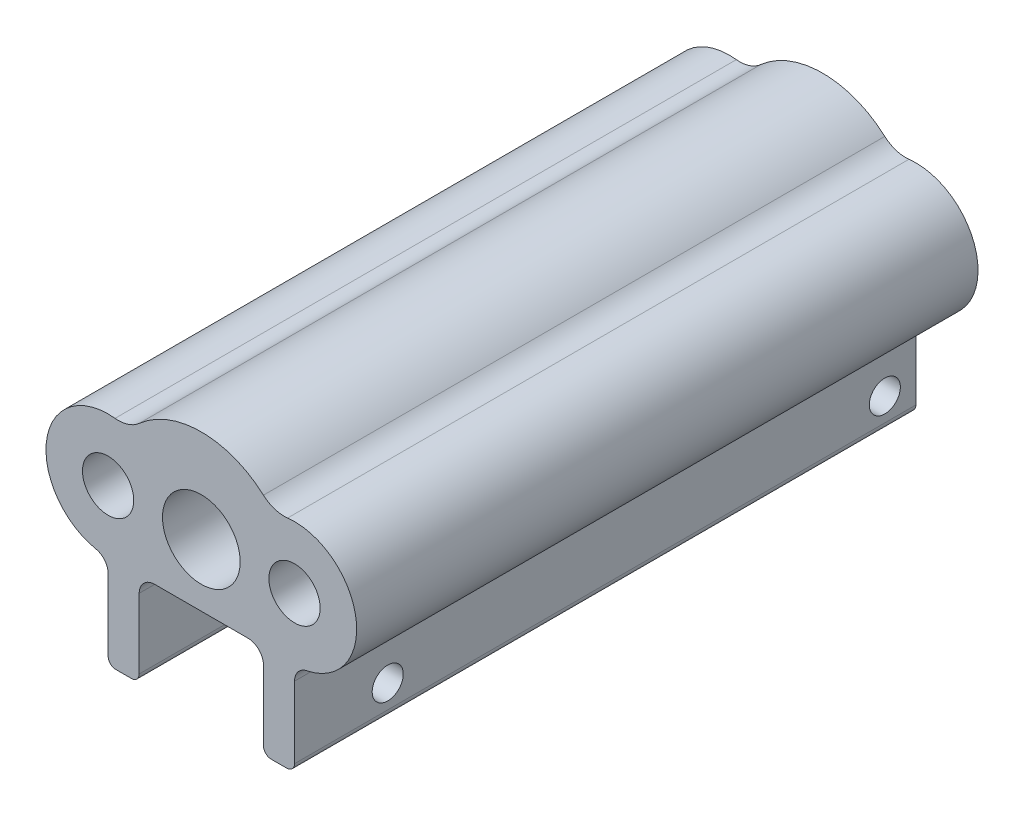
ISO-10303-21;
HEADER;
FILE_DESCRIPTION(('STEP AP214'),'2;1');
FILE_NAME('part.step','',(''),(''),'','','');
FILE_SCHEMA(('AUTOMOTIVE_DESIGN { 1 0 10303 214 1 1 1 1 }'));
ENDSEC;
DATA;
#1=APPLICATION_CONTEXT('core data for automotive mechanical design processes');
#2=APPLICATION_PROTOCOL_DEFINITION('international standard','automotive_design',2000,#1);
#3=PRODUCT_CONTEXT('',#1,'mechanical');
#4=PRODUCT('Part','Part','',(#3));
#5=PRODUCT_RELATED_PRODUCT_CATEGORY('part','',(#4));
#6=PRODUCT_DEFINITION_FORMATION('','',#4);
#7=PRODUCT_DEFINITION_CONTEXT('part definition',#1,'design');
#8=PRODUCT_DEFINITION('design','',#6,#7);
#9=PRODUCT_DEFINITION_SHAPE('','',#8);
#10=(LENGTH_UNIT() NAMED_UNIT(*) SI_UNIT(.MILLI.,.METRE.));
#11=(NAMED_UNIT(*) PLANE_ANGLE_UNIT() SI_UNIT($,.RADIAN.));
#12=(NAMED_UNIT(*) SI_UNIT($,.STERADIAN.) SOLID_ANGLE_UNIT());
#13=UNCERTAINTY_MEASURE_WITH_UNIT(LENGTH_MEASURE(1.E-05),#10,'distance_accuracy_value','');
#14=(GEOMETRIC_REPRESENTATION_CONTEXT(3) GLOBAL_UNCERTAINTY_ASSIGNED_CONTEXT((#13)) GLOBAL_UNIT_ASSIGNED_CONTEXT((#10,
#11,#12)) REPRESENTATION_CONTEXT('',''));
#15=CARTESIAN_POINT('',(0.,0.,0.));
#16=DIRECTION('',(0.,0.,1.));
#17=DIRECTION('',(1.,0.,0.));
#18=AXIS2_PLACEMENT_3D('',#15,#16,#17);
#19=CARTESIAN_POINT('',(-3.,0.,0.));
#20=DIRECTION('',(0.,0.,1.));
#21=DIRECTION('',(1.,0.,0.));
#22=AXIS2_PLACEMENT_3D('',#19,#20,#21);
#23=PLANE('',#22);
#24=CARTESIAN_POINT('',(-6.,0.,0.));
#25=DIRECTION('',(0.,0.,-1.));
#26=DIRECTION('',(-1.,0.,0.));
#27=AXIS2_PLACEMENT_3D('',#24,#25,#26);
#28=CIRCLE('',#27,1.64999999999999);
#29=CARTESIAN_POINT('',(-7.64999999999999,0.,0.));
#30=VERTEX_POINT('',#29);
#31=EDGE_CURVE('E824',#30,#30,#28,.T.);
#32=ORIENTED_EDGE('',*,*,#31,.F.);
#33=EDGE_LOOP('',(#32));
#34=FACE_BOUND('',#33,.T.);
#35=CARTESIAN_POINT('',(0.,0.,0.));
#36=DIRECTION('',(0.,0.,1.));
#37=DIRECTION('',(1.,0.,0.));
#38=AXIS2_PLACEMENT_3D('',#35,#36,#37);
#39=CIRCLE('',#38,2.5);
#40=CARTESIAN_POINT('',(2.5,0.,0.));
#41=VERTEX_POINT('',#40);
#42=EDGE_CURVE('E206',#41,#41,#39,.F.);
#43=ORIENTED_EDGE('',*,*,#42,.F.);
#44=EDGE_LOOP('',(#43));
#45=FACE_BOUND('',#44,.T.);
#46=DIRECTION('',(0.,-1.,0.));
#47=VECTOR('',#46,1.);
#48=CARTESIAN_POINT('',(-4.,-4.,0.));
#49=LINE('',#48,#47);
#50=CARTESIAN_POINT('',(-4.,-5.,0.));
#51=VERTEX_POINT('',#50);
#52=CARTESIAN_POINT('',(-4.,-9.5,0.));
#53=VERTEX_POINT('',#52);
#54=EDGE_CURVE('E353',#51,#53,#49,.T.);
#55=ORIENTED_EDGE('',*,*,#54,.T.);
#56=CARTESIAN_POINT('',(-4.5,-9.5,0.));
#57=DIRECTION('',(0.,0.,1.));
#58=DIRECTION('',(1.,0.,0.));
#59=AXIS2_PLACEMENT_3D('',#56,#57,#58);
#60=CIRCLE('',#59,0.5);
#61=CARTESIAN_POINT('',(-4.5,-10.,0.));
#62=VERTEX_POINT('',#61);
#63=EDGE_CURVE('E276',#53,#62,#60,.F.);
#64=ORIENTED_EDGE('',*,*,#63,.T.);
#65=DIRECTION('',(-1.,0.,0.));
#66=VECTOR('',#65,1.);
#67=CARTESIAN_POINT('',(-6.,-10.,0.));
#68=LINE('',#67,#66);
#69=CARTESIAN_POINT('',(-5.5,-10.,0.));
#70=VERTEX_POINT('',#69);
#71=EDGE_CURVE('E374',#62,#70,#68,.T.);
#72=ORIENTED_EDGE('',*,*,#71,.T.);
#73=CARTESIAN_POINT('',(-5.5,-9.5,0.));
#74=DIRECTION('',(0.,0.,1.));
#75=DIRECTION('',(1.,0.,0.));
#76=AXIS2_PLACEMENT_3D('',#73,#74,#75);
#77=CIRCLE('',#76,0.5);
#78=CARTESIAN_POINT('',(-6.,-9.5,0.));
#79=VERTEX_POINT('',#78);
#80=EDGE_CURVE('E274',#70,#79,#77,.F.);
#81=ORIENTED_EDGE('',*,*,#80,.T.);
#82=DIRECTION('',(0.,1.,0.));
#83=VECTOR('',#82,1.);
#84=CARTESIAN_POINT('',(-6.,-3.,0.));
#85=LINE('',#84,#83);
#86=CARTESIAN_POINT('',(-6.,-4.89897948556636,0.));
#87=VERTEX_POINT('',#86);
#88=EDGE_CURVE('E371',#79,#87,#85,.T.);
#89=ORIENTED_EDGE('',*,*,#88,.T.);
#90=CARTESIAN_POINT('',(-7.,-4.89897948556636,0.));
#91=DIRECTION('',(0.,0.,1.));
#92=DIRECTION('',(1.,0.,0.));
#93=AXIS2_PLACEMENT_3D('',#90,#91,#92);
#94=CIRCLE('',#93,1.);
#95=CARTESIAN_POINT('',(-6.8,-3.91918358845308,0.));
#96=VERTEX_POINT('',#95);
#97=EDGE_CURVE('E241',#87,#96,#94,.T.);
#98=ORIENTED_EDGE('',*,*,#97,.T.);
#99=CARTESIAN_POINT('',(-6.,0.,0.));
#100=DIRECTION('',(0.,0.,1.));
#101=DIRECTION('',(1.,0.,0.));
#102=AXIS2_PLACEMENT_3D('',#99,#100,#101);
#103=CIRCLE('',#102,4.);
#104=CARTESIAN_POINT('',(-5.55555555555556,3.97523195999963,0.));
#105=VERTEX_POINT('',#104);
#106=EDGE_CURVE('E205',#105,#96,#103,.T.);
#107=ORIENTED_EDGE('',*,*,#106,.F.);
#108=CARTESIAN_POINT('',(-5.33333333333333,5.96284793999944,0.));
#109=DIRECTION('',(0.,0.,1.));
#110=DIRECTION('',(1.,0.,0.));
#111=AXIS2_PLACEMENT_3D('',#108,#109,#110);
#112=CIRCLE('',#111,2.);
#113=CARTESIAN_POINT('',(-4.,4.47213595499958,0.));
#114=VERTEX_POINT('',#113);
#115=EDGE_CURVE('E204',#105,#114,#112,.T.);
#116=ORIENTED_EDGE('',*,*,#115,.T.);
#117=CARTESIAN_POINT('',(0.,0.,0.));
#118=DIRECTION('',(0.,0.,1.));
#119=DIRECTION('',(1.,0.,0.));
#120=AXIS2_PLACEMENT_3D('',#117,#118,#119);
#121=CIRCLE('',#120,6.);
#122=CARTESIAN_POINT('',(4.,4.47213595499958,0.));
#123=VERTEX_POINT('',#122);
#124=EDGE_CURVE('E195',#123,#114,#121,.T.);
#125=ORIENTED_EDGE('',*,*,#124,.F.);
#126=CARTESIAN_POINT('',(5.33333333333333,5.96284793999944,0.));
#127=DIRECTION('',(0.,0.,1.));
#128=DIRECTION('',(1.,0.,0.));
#129=AXIS2_PLACEMENT_3D('',#126,#127,#128);
#130=CIRCLE('',#129,2.);
#131=CARTESIAN_POINT('',(5.55555555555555,3.97523195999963,0.));
#132=VERTEX_POINT('',#131);
#133=EDGE_CURVE('E178',#123,#132,#130,.T.);
#134=ORIENTED_EDGE('',*,*,#133,.T.);
#135=CARTESIAN_POINT('',(6.,0.,0.));
#136=DIRECTION('',(0.,0.,1.));
#137=DIRECTION('',(1.,0.,0.));
#138=AXIS2_PLACEMENT_3D('',#135,#136,#137);
#139=CIRCLE('',#138,4.);
#140=CARTESIAN_POINT('',(6.8,-3.91918358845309,0.));
#141=VERTEX_POINT('',#140);
#142=EDGE_CURVE('E209',#141,#132,#139,.T.);
#143=ORIENTED_EDGE('',*,*,#142,.F.);
#144=CARTESIAN_POINT('',(7.,-4.89897948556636,0.));
#145=DIRECTION('',(0.,0.,1.));
#146=DIRECTION('',(1.,0.,0.));
#147=AXIS2_PLACEMENT_3D('',#144,#145,#146);
#148=CIRCLE('',#147,1.);
#149=CARTESIAN_POINT('',(6.,-4.89897948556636,0.));
#150=VERTEX_POINT('',#149);
#151=EDGE_CURVE('E243',#141,#150,#148,.T.);
#152=ORIENTED_EDGE('',*,*,#151,.T.);
#153=DIRECTION('',(0.,-1.,0.));
#154=VECTOR('',#153,1.);
#155=CARTESIAN_POINT('',(6.,-3.,0.));
#156=LINE('',#155,#154);
#157=CARTESIAN_POINT('',(6.,-9.5,0.));
#158=VERTEX_POINT('',#157);
#159=EDGE_CURVE('E368',#150,#158,#156,.T.);
#160=ORIENTED_EDGE('',*,*,#159,.T.);
#161=CARTESIAN_POINT('',(5.5,-9.5,0.));
#162=DIRECTION('',(0.,0.,1.));
#163=DIRECTION('',(1.,0.,0.));
#164=AXIS2_PLACEMENT_3D('',#161,#162,#163);
#165=CIRCLE('',#164,0.5);
#166=CARTESIAN_POINT('',(5.5,-10.,0.));
#167=VERTEX_POINT('',#166);
#168=EDGE_CURVE('E270',#158,#167,#165,.F.);
#169=ORIENTED_EDGE('',*,*,#168,.T.);
#170=CARTESIAN_POINT('',(4.5,-10.,0.));
#171=VERTEX_POINT('',#170);
#172=EDGE_CURVE('E381',#167,#171,#68,.T.);
#173=ORIENTED_EDGE('',*,*,#172,.T.);
#174=CARTESIAN_POINT('',(4.5,-9.5,0.));
#175=DIRECTION('',(0.,0.,1.));
#176=DIRECTION('',(1.,0.,0.));
#177=AXIS2_PLACEMENT_3D('',#174,#175,#176);
#178=CIRCLE('',#177,0.5);
#179=CARTESIAN_POINT('',(4.,-9.5,0.));
#180=VERTEX_POINT('',#179);
#181=EDGE_CURVE('E272',#171,#180,#178,.F.);
#182=ORIENTED_EDGE('',*,*,#181,.T.);
#183=DIRECTION('',(0.,1.,0.));
#184=VECTOR('',#183,1.);
#185=CARTESIAN_POINT('',(4.,-4.,0.));
#186=LINE('',#185,#184);
#187=CARTESIAN_POINT('',(4.,-5.,0.));
#188=VERTEX_POINT('',#187);
#189=EDGE_CURVE('E355',#180,#188,#186,.T.);
#190=ORIENTED_EDGE('',*,*,#189,.T.);
#191=CARTESIAN_POINT('',(3.,-5.,0.));
#192=DIRECTION('',(0.,0.,1.));
#193=DIRECTION('',(1.,0.,0.));
#194=AXIS2_PLACEMENT_3D('',#191,#192,#193);
#195=CIRCLE('',#194,1.);
#196=CARTESIAN_POINT('',(3.,-4.,0.));
#197=VERTEX_POINT('',#196);
#198=EDGE_CURVE('E265',#188,#197,#195,.T.);
#199=ORIENTED_EDGE('',*,*,#198,.T.);
#200=DIRECTION('',(-1.,0.,0.));
#201=VECTOR('',#200,1.);
#202=CARTESIAN_POINT('',(-4.,-4.,0.));
#203=LINE('',#202,#201);
#204=CARTESIAN_POINT('',(-3.,-4.,0.));
#205=VERTEX_POINT('',#204);
#206=EDGE_CURVE('E358',#197,#205,#203,.T.);
#207=ORIENTED_EDGE('',*,*,#206,.T.);
#208=CARTESIAN_POINT('',(-3.,-5.,0.));
#209=DIRECTION('',(0.,0.,1.));
#210=DIRECTION('',(1.,0.,0.));
#211=AXIS2_PLACEMENT_3D('',#208,#209,#210);
#212=CIRCLE('',#211,1.);
#213=EDGE_CURVE('E260',#205,#51,#212,.T.);
#214=ORIENTED_EDGE('',*,*,#213,.T.);
#215=EDGE_LOOP('',(#55,#64,#72,#81,#89,#98,#107,#116,#125,#134,#143,#152,#160,#169,#173,#182,
#190,#199,#207,#214));
#216=FACE_BOUND('',#215,.T.);
#217=CARTESIAN_POINT('',(6.,0.,0.));
#218=DIRECTION('',(0.,0.,-1.));
#219=DIRECTION('',(-1.,0.,0.));
#220=AXIS2_PLACEMENT_3D('',#217,#218,#219);
#221=CIRCLE('',#220,1.65);
#222=CARTESIAN_POINT('',(4.35,0.,0.));
#223=VERTEX_POINT('',#222);
#224=EDGE_CURVE('E313',#223,#223,#221,.T.);
#225=ORIENTED_EDGE('',*,*,#224,.F.);
#226=EDGE_LOOP('',(#225));
#227=FACE_BOUND('',#226,.T.);
#228=ADVANCED_FACE('F38',(#34,#45,#216,#227),#23,.F.);
#229=CARTESIAN_POINT('',(-6.,-10.,-13.8924439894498));
#230=DIRECTION('',(0.,-1.,0.));
#231=DIRECTION('',(0.,0.,-1.));
#232=AXIS2_PLACEMENT_3D('',#229,#230,#231);
#233=PLANE('',#232);
#234=ORIENTED_EDGE('',*,*,#71,.F.);
#235=DIRECTION('',(0.,0.,-1.));
#236=VECTOR('',#235,1.);
#237=CARTESIAN_POINT('',(-4.5,-10.,40.));
#238=LINE('',#237,#236);
#239=CARTESIAN_POINT('',(-4.5,-10.,40.));
#240=VERTEX_POINT('',#239);
#241=EDGE_CURVE('E280',#62,#240,#238,.F.);
#242=ORIENTED_EDGE('',*,*,#241,.T.);
#243=DIRECTION('',(1.,0.,0.));
#244=VECTOR('',#243,1.);
#245=CARTESIAN_POINT('',(-6.,-10.,40.));
#246=LINE('',#245,#244);
#247=CARTESIAN_POINT('',(-5.5,-10.,40.));
#248=VERTEX_POINT('',#247);
#249=EDGE_CURVE('E379',#248,#240,#246,.T.);
#250=ORIENTED_EDGE('',*,*,#249,.F.);
#251=DIRECTION('',(0.,0.,1.));
#252=VECTOR('',#251,1.);
#253=CARTESIAN_POINT('',(-5.5,-10.,-13.8924439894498));
#254=LINE('',#253,#252);
#255=EDGE_CURVE('E278',#248,#70,#254,.F.);
#256=ORIENTED_EDGE('',*,*,#255,.T.);
#257=EDGE_LOOP('',(#234,#242,#250,#256));
#258=FACE_BOUND('',#257,.T.);
#259=ADVANCED_FACE('F420',(#258),#233,.T.);
#260=CARTESIAN_POINT('',(0.,0.,40.));
#261=DIRECTION('',(0.,0.,-1.));
#262=DIRECTION('',(-1.,0.,0.));
#263=AXIS2_PLACEMENT_3D('',#260,#261,#262);
#264=CYLINDRICAL_SURFACE('',#263,6.);
#265=CARTESIAN_POINT('',(0.,0.,40.));
#266=DIRECTION('',(0.,0.,1.));
#267=DIRECTION('',(1.,0.,0.));
#268=AXIS2_PLACEMENT_3D('',#265,#266,#267);
#269=CIRCLE('',#268,6.);
#270=CARTESIAN_POINT('',(4.,4.47213595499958,40.));
#271=VERTEX_POINT('',#270);
#272=CARTESIAN_POINT('',(-4.,4.47213595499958,40.));
#273=VERTEX_POINT('',#272);
#274=EDGE_CURVE('E198',#271,#273,#269,.T.);
#275=ORIENTED_EDGE('',*,*,#274,.F.);
#276=DIRECTION('',(0.,0.,-1.));
#277=VECTOR('',#276,1.);
#278=CARTESIAN_POINT('',(4.,4.47213595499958,40.));
#279=LINE('',#278,#277);
#280=EDGE_CURVE('E182',#271,#123,#279,.T.);
#281=ORIENTED_EDGE('',*,*,#280,.T.);
#282=ORIENTED_EDGE('',*,*,#124,.T.);
#283=DIRECTION('',(0.,0.,-1.));
#284=VECTOR('',#283,1.);
#285=CARTESIAN_POINT('',(-4.,4.47213595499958,40.));
#286=LINE('',#285,#284);
#287=EDGE_CURVE('E199',#114,#273,#286,.F.);
#288=ORIENTED_EDGE('',*,*,#287,.T.);
#289=EDGE_LOOP('',(#275,#281,#282,#288));
#290=FACE_BOUND('',#289,.T.);
#291=ADVANCED_FACE('F194',(#290),#264,.T.);
#292=CARTESIAN_POINT('',(-6.,0.,40.));
#293=DIRECTION('',(0.,0.,-1.));
#294=DIRECTION('',(-1.,0.,0.));
#295=AXIS2_PLACEMENT_3D('',#292,#293,#294);
#296=CYLINDRICAL_SURFACE('',#295,4.);
#297=ORIENTED_EDGE('',*,*,#106,.T.);
#298=DIRECTION('',(0.,0.,-1.));
#299=VECTOR('',#298,1.);
#300=CARTESIAN_POINT('',(-6.8,-3.91918358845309,40.));
#301=LINE('',#300,#299);
#302=CARTESIAN_POINT('',(-6.8,-3.91918358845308,40.));
#303=VERTEX_POINT('',#302);
#304=EDGE_CURVE('E227',#96,#303,#301,.F.);
#305=ORIENTED_EDGE('',*,*,#304,.T.);
#306=CARTESIAN_POINT('',(-6.,0.,40.));
#307=DIRECTION('',(0.,0.,1.));
#308=DIRECTION('',(1.,0.,0.));
#309=AXIS2_PLACEMENT_3D('',#306,#307,#308);
#310=CIRCLE('',#309,4.);
#311=CARTESIAN_POINT('',(-5.55555555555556,3.97523195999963,40.));
#312=VERTEX_POINT('',#311);
#313=EDGE_CURVE('E386',#312,#303,#310,.T.);
#314=ORIENTED_EDGE('',*,*,#313,.F.);
#315=DIRECTION('',(0.,0.,-1.));
#316=VECTOR('',#315,1.);
#317=CARTESIAN_POINT('',(-5.55555555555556,3.97523195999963,40.));
#318=LINE('',#317,#316);
#319=EDGE_CURVE('E189',#312,#105,#318,.T.);
#320=ORIENTED_EDGE('',*,*,#319,.T.);
#321=EDGE_LOOP('',(#297,#305,#314,#320));
#322=FACE_BOUND('',#321,.T.);
#323=ADVANCED_FACE('F436',(#322),#296,.T.);
#324=CARTESIAN_POINT('',(6.,0.,40.));
#325=DIRECTION('',(0.,0.,-1.));
#326=DIRECTION('',(-1.,0.,0.));
#327=AXIS2_PLACEMENT_3D('',#324,#325,#326);
#328=CYLINDRICAL_SURFACE('',#327,4.);
#329=CARTESIAN_POINT('',(6.,0.,40.));
#330=DIRECTION('',(0.,0.,1.));
#331=DIRECTION('',(1.,0.,0.));
#332=AXIS2_PLACEMENT_3D('',#329,#330,#331);
#333=CIRCLE('',#332,4.);
#334=CARTESIAN_POINT('',(6.8,-3.91918358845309,40.));
#335=VERTEX_POINT('',#334);
#336=CARTESIAN_POINT('',(5.55555555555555,3.97523195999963,40.));
#337=VERTEX_POINT('',#336);
#338=EDGE_CURVE('E215',#335,#337,#333,.T.);
#339=ORIENTED_EDGE('',*,*,#338,.F.);
#340=DIRECTION('',(0.,0.,-1.));
#341=VECTOR('',#340,1.);
#342=CARTESIAN_POINT('',(6.8,-3.91918358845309,40.));
#343=LINE('',#342,#341);
#344=EDGE_CURVE('E233',#335,#141,#343,.T.);
#345=ORIENTED_EDGE('',*,*,#344,.T.);
#346=ORIENTED_EDGE('',*,*,#142,.T.);
#347=DIRECTION('',(0.,0.,-1.));
#348=VECTOR('',#347,1.);
#349=CARTESIAN_POINT('',(5.55555555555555,3.97523195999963,40.));
#350=LINE('',#349,#348);
#351=EDGE_CURVE('E184',#132,#337,#350,.F.);
#352=ORIENTED_EDGE('',*,*,#351,.T.);
#353=EDGE_LOOP('',(#339,#345,#346,#352));
#354=FACE_BOUND('',#353,.T.);
#355=ADVANCED_FACE('F396',(#354),#328,.T.);
#356=CARTESIAN_POINT('',(-3.,0.,40.));
#357=DIRECTION('',(0.,0.,1.));
#358=DIRECTION('',(1.,0.,0.));
#359=AXIS2_PLACEMENT_3D('',#356,#357,#358);
#360=PLANE('',#359);
#361=CARTESIAN_POINT('',(6.,0.,40.));
#362=DIRECTION('',(0.,0.,1.));
#363=DIRECTION('',(1.,0.,0.));
#364=AXIS2_PLACEMENT_3D('',#361,#362,#363);
#365=CIRCLE('',#364,1.65);
#366=CARTESIAN_POINT('',(7.65,0.,40.));
#367=VERTEX_POINT('',#366);
#368=EDGE_CURVE('E324',#367,#367,#365,.T.);
#369=ORIENTED_EDGE('',*,*,#368,.F.);
#370=EDGE_LOOP('',(#369));
#371=FACE_BOUND('',#370,.T.);
#372=CARTESIAN_POINT('',(-6.,0.,40.));
#373=DIRECTION('',(0.,0.,1.));
#374=DIRECTION('',(1.,0.,0.));
#375=AXIS2_PLACEMENT_3D('',#372,#373,#374);
#376=CIRCLE('',#375,1.65);
#377=CARTESIAN_POINT('',(-4.35,0.,40.));
#378=VERTEX_POINT('',#377);
#379=EDGE_CURVE('E317',#378,#378,#376,.T.);
#380=ORIENTED_EDGE('',*,*,#379,.F.);
#381=EDGE_LOOP('',(#380));
#382=FACE_BOUND('',#381,.T.);
#383=ORIENTED_EDGE('',*,*,#249,.T.);
#384=CARTESIAN_POINT('',(-4.5,-9.5,40.));
#385=DIRECTION('',(0.,0.,1.));
#386=DIRECTION('',(1.,0.,0.));
#387=AXIS2_PLACEMENT_3D('',#384,#385,#386);
#388=CIRCLE('',#387,0.5);
#389=CARTESIAN_POINT('',(-4.,-9.5,40.));
#390=VERTEX_POINT('',#389);
#391=EDGE_CURVE('E286',#240,#390,#388,.T.);
#392=ORIENTED_EDGE('',*,*,#391,.T.);
#393=DIRECTION('',(0.,-1.,0.));
#394=VECTOR('',#393,1.);
#395=CARTESIAN_POINT('',(-4.,-4.,40.));
#396=LINE('',#395,#394);
#397=CARTESIAN_POINT('',(-4.,-5.,40.));
#398=VERTEX_POINT('',#397);
#399=EDGE_CURVE('E352',#398,#390,#396,.T.);
#400=ORIENTED_EDGE('',*,*,#399,.F.);
#401=CARTESIAN_POINT('',(-3.,-5.,40.));
#402=DIRECTION('',(0.,0.,1.));
#403=DIRECTION('',(1.,0.,0.));
#404=AXIS2_PLACEMENT_3D('',#401,#402,#403);
#405=CIRCLE('',#404,1.);
#406=CARTESIAN_POINT('',(-3.,-4.,40.));
#407=VERTEX_POINT('',#406);
#408=EDGE_CURVE('E258',#398,#407,#405,.F.);
#409=ORIENTED_EDGE('',*,*,#408,.T.);
#410=DIRECTION('',(-1.,0.,0.));
#411=VECTOR('',#410,1.);
#412=CARTESIAN_POINT('',(-4.,-4.,40.));
#413=LINE('',#412,#411);
#414=CARTESIAN_POINT('',(3.,-4.,40.));
#415=VERTEX_POINT('',#414);
#416=EDGE_CURVE('E356',#415,#407,#413,.T.);
#417=ORIENTED_EDGE('',*,*,#416,.F.);
#418=CARTESIAN_POINT('',(3.,-5.,40.));
#419=DIRECTION('',(0.,0.,1.));
#420=DIRECTION('',(1.,0.,0.));
#421=AXIS2_PLACEMENT_3D('',#418,#419,#420);
#422=CIRCLE('',#421,1.);
#423=CARTESIAN_POINT('',(4.,-5.,40.));
#424=VERTEX_POINT('',#423);
#425=EDGE_CURVE('E262',#415,#424,#422,.F.);
#426=ORIENTED_EDGE('',*,*,#425,.T.);
#427=DIRECTION('',(0.,1.,0.));
#428=VECTOR('',#427,1.);
#429=CARTESIAN_POINT('',(4.,-4.,40.));
#430=LINE('',#429,#428);
#431=CARTESIAN_POINT('',(4.,-9.5,40.));
#432=VERTEX_POINT('',#431);
#433=EDGE_CURVE('E364',#432,#424,#430,.T.);
#434=ORIENTED_EDGE('',*,*,#433,.F.);
#435=CARTESIAN_POINT('',(4.5,-9.5,40.));
#436=DIRECTION('',(0.,0.,1.));
#437=DIRECTION('',(1.,0.,0.));
#438=AXIS2_PLACEMENT_3D('',#435,#436,#437);
#439=CIRCLE('',#438,0.5);
#440=CARTESIAN_POINT('',(4.5,-10.,40.));
#441=VERTEX_POINT('',#440);
#442=EDGE_CURVE('E283',#432,#441,#439,.T.);
#443=ORIENTED_EDGE('',*,*,#442,.T.);
#444=CARTESIAN_POINT('',(5.5,-10.,40.));
#445=VERTEX_POINT('',#444);
#446=EDGE_CURVE('E377',#441,#445,#246,.T.);
#447=ORIENTED_EDGE('',*,*,#446,.T.);
#448=CARTESIAN_POINT('',(5.5,-9.5,40.));
#449=DIRECTION('',(0.,0.,1.));
#450=DIRECTION('',(1.,0.,0.));
#451=AXIS2_PLACEMENT_3D('',#448,#449,#450);
#452=CIRCLE('',#451,0.5);
#453=CARTESIAN_POINT('',(6.,-9.5,40.));
#454=VERTEX_POINT('',#453);
#455=EDGE_CURVE('E63',#445,#454,#452,.T.);
#456=ORIENTED_EDGE('',*,*,#455,.T.);
#457=DIRECTION('',(0.,1.,0.));
#458=VECTOR('',#457,1.);
#459=CARTESIAN_POINT('',(6.,-3.,40.));
#460=LINE('',#459,#458);
#461=CARTESIAN_POINT('',(6.,-4.89897948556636,40.));
#462=VERTEX_POINT('',#461);
#463=EDGE_CURVE('E372',#454,#462,#460,.T.);
#464=ORIENTED_EDGE('',*,*,#463,.T.);
#465=CARTESIAN_POINT('',(7.,-4.89897948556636,40.));
#466=DIRECTION('',(0.,0.,1.));
#467=DIRECTION('',(1.,0.,0.));
#468=AXIS2_PLACEMENT_3D('',#465,#466,#467);
#469=CIRCLE('',#468,1.);
#470=EDGE_CURVE('E245',#462,#335,#469,.F.);
#471=ORIENTED_EDGE('',*,*,#470,.T.);
#472=ORIENTED_EDGE('',*,*,#338,.T.);
#473=CARTESIAN_POINT('',(5.33333333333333,5.96284793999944,40.));
#474=DIRECTION('',(0.,0.,1.));
#475=DIRECTION('',(1.,0.,0.));
#476=AXIS2_PLACEMENT_3D('',#473,#474,#475);
#477=CIRCLE('',#476,2.);
#478=EDGE_CURVE('E188',#337,#271,#477,.F.);
#479=ORIENTED_EDGE('',*,*,#478,.T.);
#480=ORIENTED_EDGE('',*,*,#274,.T.);
#481=CARTESIAN_POINT('',(-5.33333333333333,5.96284793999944,40.));
#482=DIRECTION('',(0.,0.,1.));
#483=DIRECTION('',(1.,0.,0.));
#484=AXIS2_PLACEMENT_3D('',#481,#482,#483);
#485=CIRCLE('',#484,2.);
#486=EDGE_CURVE('E225',#273,#312,#485,.F.);
#487=ORIENTED_EDGE('',*,*,#486,.T.);
#488=ORIENTED_EDGE('',*,*,#313,.T.);
#489=CARTESIAN_POINT('',(-7.,-4.89897948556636,40.));
#490=DIRECTION('',(0.,0.,1.));
#491=DIRECTION('',(1.,0.,0.));
#492=AXIS2_PLACEMENT_3D('',#489,#490,#491);
#493=CIRCLE('',#492,1.);
#494=CARTESIAN_POINT('',(-6.,-4.89897948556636,40.));
#495=VERTEX_POINT('',#494);
#496=EDGE_CURVE('E239',#303,#495,#493,.F.);
#497=ORIENTED_EDGE('',*,*,#496,.T.);
#498=DIRECTION('',(0.,-1.,0.));
#499=VECTOR('',#498,1.);
#500=CARTESIAN_POINT('',(-6.,-3.,40.));
#501=LINE('',#500,#499);
#502=CARTESIAN_POINT('',(-6.,-9.5,40.));
#503=VERTEX_POINT('',#502);
#504=EDGE_CURVE('E361',#495,#503,#501,.T.);
#505=ORIENTED_EDGE('',*,*,#504,.T.);
#506=CARTESIAN_POINT('',(-5.5,-9.5,40.));
#507=DIRECTION('',(0.,0.,1.));
#508=DIRECTION('',(1.,0.,0.));
#509=AXIS2_PLACEMENT_3D('',#506,#507,#508);
#510=CIRCLE('',#509,0.5);
#511=EDGE_CURVE('E55',#503,#248,#510,.T.);
#512=ORIENTED_EDGE('',*,*,#511,.T.);
#513=EDGE_LOOP('',(#383,#392,#400,#409,#417,#426,#434,#443,#447,#456,#464,#471,#472,#479,#480,
#487,#488,#497,#505,#512));
#514=FACE_BOUND('',#513,.T.);
#515=CARTESIAN_POINT('',(0.,0.,40.));
#516=DIRECTION('',(0.,0.,1.));
#517=DIRECTION('',(1.,0.,0.));
#518=AXIS2_PLACEMENT_3D('',#515,#516,#517);
#519=CIRCLE('',#518,2.5);
#520=CARTESIAN_POINT('',(2.5,0.,40.));
#521=VERTEX_POINT('',#520);
#522=EDGE_CURVE('E212',#521,#521,#519,.T.);
#523=ORIENTED_EDGE('',*,*,#522,.F.);
#524=EDGE_LOOP('',(#523));
#525=FACE_BOUND('',#524,.T.);
#526=ADVANCED_FACE('F391',(#371,#382,#514,#525),#360,.T.);
#527=CARTESIAN_POINT('',(5.33333333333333,5.96284793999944,40.));
#528=DIRECTION('',(0.,0.,1.));
#529=DIRECTION('',(1.,0.,0.));
#530=AXIS2_PLACEMENT_3D('',#527,#528,#529);
#531=CYLINDRICAL_SURFACE('',#530,2.);
#532=ORIENTED_EDGE('',*,*,#478,.F.);
#533=ORIENTED_EDGE('',*,*,#351,.F.);
#534=ORIENTED_EDGE('',*,*,#133,.F.);
#535=ORIENTED_EDGE('',*,*,#280,.F.);
#536=EDGE_LOOP('',(#532,#533,#534,#535));
#537=FACE_BOUND('',#536,.T.);
#538=ADVANCED_FACE('F181',(#537),#531,.F.);
#539=CARTESIAN_POINT('',(-5.33333333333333,5.96284793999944,40.));
#540=DIRECTION('',(0.,0.,1.));
#541=DIRECTION('',(1.,0.,0.));
#542=AXIS2_PLACEMENT_3D('',#539,#540,#541);
#543=CYLINDRICAL_SURFACE('',#542,2.);
#544=ORIENTED_EDGE('',*,*,#486,.F.);
#545=ORIENTED_EDGE('',*,*,#287,.F.);
#546=ORIENTED_EDGE('',*,*,#115,.F.);
#547=ORIENTED_EDGE('',*,*,#319,.F.);
#548=EDGE_LOOP('',(#544,#545,#546,#547));
#549=FACE_BOUND('',#548,.T.);
#550=ADVANCED_FACE('F444',(#549),#543,.F.);
#551=CARTESIAN_POINT('',(-6.,0.,-7.07106781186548));
#552=DIRECTION('',(0.,0.,1.));
#553=DIRECTION('',(1.,0.,0.));
#554=AXIS2_PLACEMENT_3D('',#551,#552,#553);
#555=CYLINDRICAL_SURFACE('',#554,1.6);
#556=CARTESIAN_POINT('',(-6.,0.,10.1300430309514));
#557=DIRECTION('',(0.,0.,-1.));
#558=DIRECTION('',(-1.,0.,0.));
#559=AXIS2_PLACEMENT_3D('',#556,#557,#558);
#560=CIRCLE('',#559,1.6);
#561=CARTESIAN_POINT('',(-7.6,0.,10.1300430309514));
#562=VERTEX_POINT('',#561);
#563=EDGE_CURVE('E42',#562,#562,#560,.T.);
#564=ORIENTED_EDGE('',*,*,#563,.T.);
#565=EDGE_LOOP('',(#564));
#566=FACE_BOUND('',#565,.T.);
#567=CARTESIAN_POINT('',(-6.,0.,29.8699569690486));
#568=DIRECTION('',(0.,0.,1.));
#569=DIRECTION('',(1.,0.,0.));
#570=AXIS2_PLACEMENT_3D('',#567,#568,#569);
#571=CIRCLE('',#570,1.6);
#572=CARTESIAN_POINT('',(-4.4,0.,29.8699569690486));
#573=VERTEX_POINT('',#572);
#574=EDGE_CURVE('E311',#573,#573,#571,.T.);
#575=ORIENTED_EDGE('',*,*,#574,.T.);
#576=EDGE_LOOP('',(#575));
#577=FACE_BOUND('',#576,.T.);
#578=ADVANCED_FACE('F446',(#566,#577),#555,.F.);
#579=CARTESIAN_POINT('',(0.,0.,-7.07106781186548));
#580=DIRECTION('',(0.,0.,1.));
#581=DIRECTION('',(1.,0.,0.));
#582=AXIS2_PLACEMENT_3D('',#579,#580,#581);
#583=CYLINDRICAL_SURFACE('',#582,2.5);
#584=ORIENTED_EDGE('',*,*,#42,.T.);
#585=EDGE_LOOP('',(#584));
#586=FACE_BOUND('',#585,.T.);
#587=ORIENTED_EDGE('',*,*,#522,.T.);
#588=EDGE_LOOP('',(#587));
#589=FACE_BOUND('',#588,.T.);
#590=ADVANCED_FACE('F451',(#586,#589),#583,.F.);
#591=CARTESIAN_POINT('',(6.,0.,-7.07106781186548));
#592=DIRECTION('',(0.,0.,1.));
#593=DIRECTION('',(1.,0.,0.));
#594=AXIS2_PLACEMENT_3D('',#591,#592,#593);
#595=CYLINDRICAL_SURFACE('',#594,1.5);
#596=CARTESIAN_POINT('',(6.,0.,29.8098709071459));
#597=DIRECTION('',(0.,0.,1.));
#598=DIRECTION('',(1.,0.,0.));
#599=AXIS2_PLACEMENT_3D('',#596,#597,#598);
#600=CIRCLE('',#599,1.5);
#601=CARTESIAN_POINT('',(7.5,0.,29.8098709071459));
#602=VERTEX_POINT('',#601);
#603=EDGE_CURVE('E315',#602,#602,#600,.T.);
#604=ORIENTED_EDGE('',*,*,#603,.T.);
#605=EDGE_LOOP('',(#604));
#606=FACE_BOUND('',#605,.T.);
#607=CARTESIAN_POINT('',(6.,0.,10.1901290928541));
#608=DIRECTION('',(0.,0.,-1.));
#609=DIRECTION('',(-1.,0.,0.));
#610=AXIS2_PLACEMENT_3D('',#607,#608,#609);
#611=CIRCLE('',#610,1.5);
#612=CARTESIAN_POINT('',(4.5,0.,10.1901290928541));
#613=VERTEX_POINT('',#612);
#614=EDGE_CURVE('E307',#613,#613,#611,.T.);
#615=ORIENTED_EDGE('',*,*,#614,.T.);
#616=EDGE_LOOP('',(#615));
#617=FACE_BOUND('',#616,.T.);
#618=ADVANCED_FACE('F549',(#606,#617),#595,.F.);
#619=CARTESIAN_POINT('',(-6.,-3.,-13.8924439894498));
#620=DIRECTION('',(-1.,0.,0.));
#621=DIRECTION('',(0.,-1.,0.));
#622=AXIS2_PLACEMENT_3D('',#619,#620,#621);
#623=PLANE('',#622);
#624=CARTESIAN_POINT('',(-6.,-8.,34.));
#625=DIRECTION('',(-1.,0.,0.));
#626=DIRECTION('',(0.,-1.,0.));
#627=AXIS2_PLACEMENT_3D('',#624,#625,#626);
#628=CIRCLE('',#627,0.999999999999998);
#629=CARTESIAN_POINT('',(-6.,-9.,34.));
#630=VERTEX_POINT('',#629);
#631=EDGE_CURVE('E306',#630,#630,#628,.T.);
#632=ORIENTED_EDGE('',*,*,#631,.F.);
#633=EDGE_LOOP('',(#632));
#634=FACE_BOUND('',#633,.T.);
#635=CARTESIAN_POINT('',(-6.,-8.,2.));
#636=DIRECTION('',(-1.,0.,0.));
#637=DIRECTION('',(0.,-1.,0.));
#638=AXIS2_PLACEMENT_3D('',#635,#636,#637);
#639=CIRCLE('',#638,1.);
#640=CARTESIAN_POINT('',(-6.,-9.,2.));
#641=VERTEX_POINT('',#640);
#642=EDGE_CURVE('E301',#641,#641,#639,.T.);
#643=ORIENTED_EDGE('',*,*,#642,.F.);
#644=EDGE_LOOP('',(#643));
#645=FACE_BOUND('',#644,.T.);
#646=ORIENTED_EDGE('',*,*,#88,.F.);
#647=DIRECTION('',(0.,0.,1.));
#648=VECTOR('',#647,1.);
#649=CARTESIAN_POINT('',(-6.,-9.5,-13.8924439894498));
#650=LINE('',#649,#648);
#651=EDGE_CURVE('E288',#79,#503,#650,.T.);
#652=ORIENTED_EDGE('',*,*,#651,.T.);
#653=ORIENTED_EDGE('',*,*,#504,.F.);
#654=DIRECTION('',(0.,0.,-1.));
#655=VECTOR('',#654,1.);
#656=CARTESIAN_POINT('',(-6.,-4.89897948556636,-13.8924439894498));
#657=LINE('',#656,#655);
#658=EDGE_CURVE('E230',#495,#87,#657,.T.);
#659=ORIENTED_EDGE('',*,*,#658,.T.);
#660=EDGE_LOOP('',(#646,#652,#653,#659));
#661=FACE_BOUND('',#660,.T.);
#662=ADVANCED_FACE('F461',(#634,#645,#661),#623,.T.);
#663=CARTESIAN_POINT('',(6.,-3.,-13.8924439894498));
#664=DIRECTION('',(1.,0.,0.));
#665=DIRECTION('',(0.,1.,0.));
#666=AXIS2_PLACEMENT_3D('',#663,#664,#665);
#667=PLANE('',#666);
#668=CARTESIAN_POINT('',(6.,-8.,34.));
#669=DIRECTION('',(1.,0.,0.));
#670=DIRECTION('',(0.,1.,0.));
#671=AXIS2_PLACEMENT_3D('',#668,#669,#670);
#672=CIRCLE('',#671,0.999999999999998);
#673=CARTESIAN_POINT('',(6.,-7.,34.));
#674=VERTEX_POINT('',#673);
#675=EDGE_CURVE('E342',#674,#674,#672,.T.);
#676=ORIENTED_EDGE('',*,*,#675,.F.);
#677=EDGE_LOOP('',(#676));
#678=FACE_BOUND('',#677,.T.);
#679=CARTESIAN_POINT('',(6.,-8.,2.));
#680=DIRECTION('',(1.,0.,0.));
#681=DIRECTION('',(0.,1.,0.));
#682=AXIS2_PLACEMENT_3D('',#679,#680,#681);
#683=CIRCLE('',#682,1.);
#684=CARTESIAN_POINT('',(6.,-7.,2.));
#685=VERTEX_POINT('',#684);
#686=EDGE_CURVE('E349',#685,#685,#683,.T.);
#687=ORIENTED_EDGE('',*,*,#686,.F.);
#688=EDGE_LOOP('',(#687));
#689=FACE_BOUND('',#688,.T.);
#690=ORIENTED_EDGE('',*,*,#463,.F.);
#691=DIRECTION('',(0.,0.,1.));
#692=VECTOR('',#691,1.);
#693=CARTESIAN_POINT('',(6.,-9.5,-13.8924439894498));
#694=LINE('',#693,#692);
#695=EDGE_CURVE('E11',#454,#158,#694,.F.);
#696=ORIENTED_EDGE('',*,*,#695,.T.);
#697=ORIENTED_EDGE('',*,*,#159,.F.);
#698=DIRECTION('',(0.,0.,-1.));
#699=VECTOR('',#698,1.);
#700=CARTESIAN_POINT('',(6.,-4.89897948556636,-13.8924439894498));
#701=LINE('',#700,#699);
#702=EDGE_CURVE('E236',#150,#462,#701,.F.);
#703=ORIENTED_EDGE('',*,*,#702,.T.);
#704=EDGE_LOOP('',(#690,#696,#697,#703));
#705=FACE_BOUND('',#704,.T.);
#706=ADVANCED_FACE('F402',(#678,#689,#705),#667,.T.);
#707=ORIENTED_EDGE('',*,*,#446,.F.);
#708=DIRECTION('',(0.,0.,1.));
#709=VECTOR('',#708,1.);
#710=CARTESIAN_POINT('',(4.5,-10.,0.));
#711=LINE('',#710,#709);
#712=EDGE_CURVE('E47',#441,#171,#711,.F.);
#713=ORIENTED_EDGE('',*,*,#712,.T.);
#714=ORIENTED_EDGE('',*,*,#172,.F.);
#715=DIRECTION('',(0.,0.,1.));
#716=VECTOR('',#715,1.);
#717=CARTESIAN_POINT('',(5.5,-10.,-13.8924439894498));
#718=LINE('',#717,#716);
#719=EDGE_CURVE('E293',#167,#445,#718,.T.);
#720=ORIENTED_EDGE('',*,*,#719,.T.);
#721=EDGE_LOOP('',(#707,#713,#714,#720));
#722=FACE_BOUND('',#721,.T.);
#723=ADVANCED_FACE('F428',(#722),#233,.T.);
#724=CARTESIAN_POINT('',(-4.,-4.,0.));
#725=DIRECTION('',(-1.,0.,0.));
#726=DIRECTION('',(0.,0.,1.));
#727=AXIS2_PLACEMENT_3D('',#724,#725,#726);
#728=PLANE('',#727);
#729=CARTESIAN_POINT('',(-4.,-8.,34.));
#730=DIRECTION('',(-1.,0.,0.));
#731=DIRECTION('',(0.,0.,1.));
#732=AXIS2_PLACEMENT_3D('',#729,#730,#731);
#733=CIRCLE('',#732,0.999999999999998);
#734=CARTESIAN_POINT('',(-4.,-8.,35.));
#735=VERTEX_POINT('',#734);
#736=EDGE_CURVE('E305',#735,#735,#733,.T.);
#737=ORIENTED_EDGE('',*,*,#736,.T.);
#738=EDGE_LOOP('',(#737));
#739=FACE_BOUND('',#738,.T.);
#740=CARTESIAN_POINT('',(-4.,-8.,2.));
#741=DIRECTION('',(-1.,0.,0.));
#742=DIRECTION('',(0.,0.,1.));
#743=AXIS2_PLACEMENT_3D('',#740,#741,#742);
#744=CIRCLE('',#743,1.);
#745=CARTESIAN_POINT('',(-4.,-8.,3.));
#746=VERTEX_POINT('',#745);
#747=EDGE_CURVE('E300',#746,#746,#744,.T.);
#748=ORIENTED_EDGE('',*,*,#747,.T.);
#749=EDGE_LOOP('',(#748));
#750=FACE_BOUND('',#749,.T.);
#751=ORIENTED_EDGE('',*,*,#399,.T.);
#752=DIRECTION('',(0.,0.,-1.));
#753=VECTOR('',#752,1.);
#754=CARTESIAN_POINT('',(-4.,-9.5,0.));
#755=LINE('',#754,#753);
#756=EDGE_CURVE('E267',#390,#53,#755,.T.);
#757=ORIENTED_EDGE('',*,*,#756,.T.);
#758=ORIENTED_EDGE('',*,*,#54,.F.);
#759=DIRECTION('',(0.,0.,1.));
#760=VECTOR('',#759,1.);
#761=CARTESIAN_POINT('',(-4.,-5.,40.));
#762=LINE('',#761,#760);
#763=EDGE_CURVE('E247',#51,#398,#762,.T.);
#764=ORIENTED_EDGE('',*,*,#763,.T.);
#765=EDGE_LOOP('',(#751,#757,#758,#764));
#766=FACE_BOUND('',#765,.T.);
#767=ADVANCED_FACE('F474',(#739,#750,#766),#728,.F.);
#768=CARTESIAN_POINT('',(-4.,-4.,0.));
#769=DIRECTION('',(0.,1.,0.));
#770=DIRECTION('',(0.,0.,1.));
#771=AXIS2_PLACEMENT_3D('',#768,#769,#770);
#772=PLANE('',#771);
#773=ORIENTED_EDGE('',*,*,#416,.T.);
#774=DIRECTION('',(0.,0.,1.));
#775=VECTOR('',#774,1.);
#776=CARTESIAN_POINT('',(-3.,-4.,0.));
#777=LINE('',#776,#775);
#778=EDGE_CURVE('E253',#407,#205,#777,.F.);
#779=ORIENTED_EDGE('',*,*,#778,.T.);
#780=ORIENTED_EDGE('',*,*,#206,.F.);
#781=DIRECTION('',(0.,0.,1.));
#782=VECTOR('',#781,1.);
#783=CARTESIAN_POINT('',(3.,-4.,40.));
#784=LINE('',#783,#782);
#785=EDGE_CURVE('E250',#197,#415,#784,.T.);
#786=ORIENTED_EDGE('',*,*,#785,.T.);
#787=EDGE_LOOP('',(#773,#779,#780,#786));
#788=FACE_BOUND('',#787,.T.);
#789=ADVANCED_FACE('F481',(#788),#772,.F.);
#790=CARTESIAN_POINT('',(4.,-4.,0.));
#791=DIRECTION('',(1.,0.,0.));
#792=DIRECTION('',(0.,0.,-1.));
#793=AXIS2_PLACEMENT_3D('',#790,#791,#792);
#794=PLANE('',#793);
#795=CARTESIAN_POINT('',(4.,-8.,34.));
#796=DIRECTION('',(1.,0.,0.));
#797=DIRECTION('',(0.,0.,-1.));
#798=AXIS2_PLACEMENT_3D('',#795,#796,#797);
#799=CIRCLE('',#798,0.999999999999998);
#800=CARTESIAN_POINT('',(4.,-8.,33.));
#801=VERTEX_POINT('',#800);
#802=EDGE_CURVE('E302',#801,#801,#799,.T.);
#803=ORIENTED_EDGE('',*,*,#802,.T.);
#804=EDGE_LOOP('',(#803));
#805=FACE_BOUND('',#804,.T.);
#806=CARTESIAN_POINT('',(4.,-8.,2.));
#807=DIRECTION('',(1.,0.,0.));
#808=DIRECTION('',(0.,0.,-1.));
#809=AXIS2_PLACEMENT_3D('',#806,#807,#808);
#810=CIRCLE('',#809,1.);
#811=CARTESIAN_POINT('',(4.,-8.,1.));
#812=VERTEX_POINT('',#811);
#813=EDGE_CURVE('E297',#812,#812,#810,.T.);
#814=ORIENTED_EDGE('',*,*,#813,.T.);
#815=EDGE_LOOP('',(#814));
#816=FACE_BOUND('',#815,.T.);
#817=ORIENTED_EDGE('',*,*,#189,.F.);
#818=DIRECTION('',(0.,0.,1.));
#819=VECTOR('',#818,1.);
#820=CARTESIAN_POINT('',(4.,-9.5,40.));
#821=LINE('',#820,#819);
#822=EDGE_CURVE('E290',#180,#432,#821,.T.);
#823=ORIENTED_EDGE('',*,*,#822,.T.);
#824=ORIENTED_EDGE('',*,*,#433,.T.);
#825=DIRECTION('',(0.,0.,1.));
#826=VECTOR('',#825,1.);
#827=CARTESIAN_POINT('',(4.,-5.,0.));
#828=LINE('',#827,#826);
#829=EDGE_CURVE('E255',#424,#188,#828,.F.);
#830=ORIENTED_EDGE('',*,*,#829,.T.);
#831=EDGE_LOOP('',(#817,#823,#824,#830));
#832=FACE_BOUND('',#831,.T.);
#833=ADVANCED_FACE('F416',(#805,#816,#832),#794,.F.);
#834=CARTESIAN_POINT('',(-7.,-4.89897948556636,40.));
#835=DIRECTION('',(0.,0.,-1.));
#836=DIRECTION('',(-1.,0.,0.));
#837=AXIS2_PLACEMENT_3D('',#834,#835,#836);
#838=CYLINDRICAL_SURFACE('',#837,1.);
#839=ORIENTED_EDGE('',*,*,#97,.F.);
#840=ORIENTED_EDGE('',*,*,#658,.F.);
#841=ORIENTED_EDGE('',*,*,#496,.F.);
#842=ORIENTED_EDGE('',*,*,#304,.F.);
#843=EDGE_LOOP('',(#839,#840,#841,#842));
#844=FACE_BOUND('',#843,.T.);
#845=ADVANCED_FACE('F407',(#844),#838,.F.);
#846=CARTESIAN_POINT('',(7.,-4.89897948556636,40.));
#847=DIRECTION('',(0.,0.,-1.));
#848=DIRECTION('',(-1.,0.,0.));
#849=AXIS2_PLACEMENT_3D('',#846,#847,#848);
#850=CYLINDRICAL_SURFACE('',#849,1.);
#851=ORIENTED_EDGE('',*,*,#470,.F.);
#852=ORIENTED_EDGE('',*,*,#702,.F.);
#853=ORIENTED_EDGE('',*,*,#151,.F.);
#854=ORIENTED_EDGE('',*,*,#344,.F.);
#855=EDGE_LOOP('',(#851,#852,#853,#854));
#856=FACE_BOUND('',#855,.T.);
#857=ADVANCED_FACE('F404',(#856),#850,.F.);
#858=CARTESIAN_POINT('',(-3.,-5.,0.));
#859=DIRECTION('',(0.,0.,-1.));
#860=DIRECTION('',(-1.,0.,0.));
#861=AXIS2_PLACEMENT_3D('',#858,#859,#860);
#862=CYLINDRICAL_SURFACE('',#861,1.);
#863=ORIENTED_EDGE('',*,*,#213,.F.);
#864=ORIENTED_EDGE('',*,*,#778,.F.);
#865=ORIENTED_EDGE('',*,*,#408,.F.);
#866=ORIENTED_EDGE('',*,*,#763,.F.);
#867=EDGE_LOOP('',(#863,#864,#865,#866));
#868=FACE_BOUND('',#867,.T.);
#869=ADVANCED_FACE('F406',(#868),#862,.F.);
#870=CARTESIAN_POINT('',(3.,-5.,0.));
#871=DIRECTION('',(0.,0.,-1.));
#872=DIRECTION('',(-1.,0.,0.));
#873=AXIS2_PLACEMENT_3D('',#870,#871,#872);
#874=CYLINDRICAL_SURFACE('',#873,1.);
#875=ORIENTED_EDGE('',*,*,#198,.F.);
#876=ORIENTED_EDGE('',*,*,#829,.F.);
#877=ORIENTED_EDGE('',*,*,#425,.F.);
#878=ORIENTED_EDGE('',*,*,#785,.F.);
#879=EDGE_LOOP('',(#875,#876,#877,#878));
#880=FACE_BOUND('',#879,.T.);
#881=ADVANCED_FACE('F413',(#880),#874,.F.);
#882=CARTESIAN_POINT('',(-4.5,-9.5,0.));
#883=DIRECTION('',(0.,0.,1.));
#884=DIRECTION('',(1.,0.,0.));
#885=AXIS2_PLACEMENT_3D('',#882,#883,#884);
#886=CYLINDRICAL_SURFACE('',#885,0.5);
#887=ORIENTED_EDGE('',*,*,#391,.F.);
#888=ORIENTED_EDGE('',*,*,#241,.F.);
#889=ORIENTED_EDGE('',*,*,#63,.F.);
#890=ORIENTED_EDGE('',*,*,#756,.F.);
#891=EDGE_LOOP('',(#887,#888,#889,#890));
#892=FACE_BOUND('',#891,.T.);
#893=ADVANCED_FACE('F470',(#892),#886,.T.);
#894=CARTESIAN_POINT('',(-5.5,-9.5,-13.8924439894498));
#895=DIRECTION('',(0.,0.,1.));
#896=DIRECTION('',(1.,0.,0.));
#897=AXIS2_PLACEMENT_3D('',#894,#895,#896);
#898=CYLINDRICAL_SURFACE('',#897,0.5);
#899=ORIENTED_EDGE('',*,*,#80,.F.);
#900=ORIENTED_EDGE('',*,*,#255,.F.);
#901=ORIENTED_EDGE('',*,*,#511,.F.);
#902=ORIENTED_EDGE('',*,*,#651,.F.);
#903=EDGE_LOOP('',(#899,#900,#901,#902));
#904=FACE_BOUND('',#903,.T.);
#905=ADVANCED_FACE('F463',(#904),#898,.T.);
#906=CARTESIAN_POINT('',(4.5,-9.5,0.));
#907=DIRECTION('',(0.,0.,-1.));
#908=DIRECTION('',(-1.,0.,0.));
#909=AXIS2_PLACEMENT_3D('',#906,#907,#908);
#910=CYLINDRICAL_SURFACE('',#909,0.5);
#911=ORIENTED_EDGE('',*,*,#181,.F.);
#912=ORIENTED_EDGE('',*,*,#712,.F.);
#913=ORIENTED_EDGE('',*,*,#442,.F.);
#914=ORIENTED_EDGE('',*,*,#822,.F.);
#915=EDGE_LOOP('',(#911,#912,#913,#914));
#916=FACE_BOUND('',#915,.T.);
#917=ADVANCED_FACE('F494',(#916),#910,.T.);
#918=CARTESIAN_POINT('',(5.5,-9.5,-13.8924439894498));
#919=DIRECTION('',(0.,0.,1.));
#920=DIRECTION('',(1.,0.,0.));
#921=AXIS2_PLACEMENT_3D('',#918,#919,#920);
#922=CYLINDRICAL_SURFACE('',#921,0.5);
#923=ORIENTED_EDGE('',*,*,#168,.F.);
#924=ORIENTED_EDGE('',*,*,#695,.F.);
#925=ORIENTED_EDGE('',*,*,#455,.F.);
#926=ORIENTED_EDGE('',*,*,#719,.F.);
#927=EDGE_LOOP('',(#923,#924,#925,#926));
#928=FACE_BOUND('',#927,.T.);
#929=ADVANCED_FACE('F40',(#928),#922,.T.);
#930=CARTESIAN_POINT('',(10.,-8.,2.));
#931=DIRECTION('',(-1.,0.,0.));
#932=DIRECTION('',(0.,-1.,0.));
#933=AXIS2_PLACEMENT_3D('',#930,#931,#932);
#934=CYLINDRICAL_SURFACE('',#933,1.);
#935=ORIENTED_EDGE('',*,*,#686,.T.);
#936=EDGE_LOOP('',(#935));
#937=FACE_BOUND('',#936,.T.);
#938=ORIENTED_EDGE('',*,*,#813,.F.);
#939=EDGE_LOOP('',(#938));
#940=FACE_BOUND('',#939,.T.);
#941=ADVANCED_FACE('F501',(#937,#940),#934,.F.);
#942=ORIENTED_EDGE('',*,*,#642,.T.);
#943=EDGE_LOOP('',(#942));
#944=FACE_BOUND('',#943,.T.);
#945=ORIENTED_EDGE('',*,*,#747,.F.);
#946=EDGE_LOOP('',(#945));
#947=FACE_BOUND('',#946,.T.);
#948=ADVANCED_FACE('F506',(#944,#947),#934,.F.);
#949=CARTESIAN_POINT('',(10.,-8.,34.));
#950=DIRECTION('',(-1.,0.,0.));
#951=DIRECTION('',(0.,-1.,0.));
#952=AXIS2_PLACEMENT_3D('',#949,#950,#951);
#953=CYLINDRICAL_SURFACE('',#952,0.999999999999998);
#954=ORIENTED_EDGE('',*,*,#675,.T.);
#955=EDGE_LOOP('',(#954));
#956=FACE_BOUND('',#955,.T.);
#957=ORIENTED_EDGE('',*,*,#802,.F.);
#958=EDGE_LOOP('',(#957));
#959=FACE_BOUND('',#958,.T.);
#960=ADVANCED_FACE('F599',(#956,#959),#953,.F.);
#961=ORIENTED_EDGE('',*,*,#631,.T.);
#962=EDGE_LOOP('',(#961));
#963=FACE_BOUND('',#962,.T.);
#964=ORIENTED_EDGE('',*,*,#736,.F.);
#965=EDGE_LOOP('',(#964));
#966=FACE_BOUND('',#965,.T.);
#967=ADVANCED_FACE('F608',(#963,#966),#953,.F.);
#968=CARTESIAN_POINT('',(6.,0.,10.1));
#969=DIRECTION('',(0.,0.,-1.));
#970=DIRECTION('',(-1.,0.,0.));
#971=AXIS2_PLACEMENT_3D('',#968,#969,#970);
#972=CONICAL_SURFACE('',#971,1.65,1.02974425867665);
#973=CARTESIAN_POINT('',(6.,0.,10.1));
#974=DIRECTION('',(0.,0.,-1.));
#975=DIRECTION('',(-1.,0.,0.));
#976=AXIS2_PLACEMENT_3D('',#973,#974,#975);
#977=CIRCLE('',#976,1.65);
#978=CARTESIAN_POINT('',(4.35,0.,10.1));
#979=VERTEX_POINT('',#978);
#980=EDGE_CURVE('E310',#979,#979,#977,.T.);
#981=ORIENTED_EDGE('',*,*,#980,.T.);
#982=EDGE_LOOP('',(#981));
#983=FACE_BOUND('',#982,.T.);
#984=ORIENTED_EDGE('',*,*,#614,.F.);
#985=EDGE_LOOP('',(#984));
#986=FACE_BOUND('',#985,.T.);
#987=ADVANCED_FACE('F618',(#983,#986),#972,.F.);
#988=CARTESIAN_POINT('',(6.,0.,0.));
#989=DIRECTION('',(0.,0.,-1.));
#990=DIRECTION('',(-1.,0.,0.));
#991=AXIS2_PLACEMENT_3D('',#988,#989,#990);
#992=CYLINDRICAL_SURFACE('',#991,1.65);
#993=ORIENTED_EDGE('',*,*,#980,.F.);
#994=EDGE_LOOP('',(#993));
#995=FACE_BOUND('',#994,.T.);
#996=ORIENTED_EDGE('',*,*,#224,.T.);
#997=EDGE_LOOP('',(#996));
#998=FACE_BOUND('',#997,.T.);
#999=ADVANCED_FACE('F647',(#995,#998),#992,.F.);
#1000=CARTESIAN_POINT('',(-6.,0.,29.9));
#1001=DIRECTION('',(0.,0.,1.));
#1002=DIRECTION('',(1.,0.,0.));
#1003=AXIS2_PLACEMENT_3D('',#1000,#1001,#1002);
#1004=CONICAL_SURFACE('',#1003,1.65,1.02974425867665);
#1005=CARTESIAN_POINT('',(-6.,0.,29.9));
#1006=DIRECTION('',(0.,0.,1.));
#1007=DIRECTION('',(1.,0.,0.));
#1008=AXIS2_PLACEMENT_3D('',#1005,#1006,#1007);
#1009=CIRCLE('',#1008,1.65);
#1010=CARTESIAN_POINT('',(-4.35,0.,29.9));
#1011=VERTEX_POINT('',#1010);
#1012=EDGE_CURVE('E314',#1011,#1011,#1009,.T.);
#1013=ORIENTED_EDGE('',*,*,#1012,.T.);
#1014=EDGE_LOOP('',(#1013));
#1015=FACE_BOUND('',#1014,.T.);
#1016=ORIENTED_EDGE('',*,*,#574,.F.);
#1017=EDGE_LOOP('',(#1016));
#1018=FACE_BOUND('',#1017,.T.);
#1019=ADVANCED_FACE('F658',(#1015,#1018),#1004,.F.);
#1020=CARTESIAN_POINT('',(-6.,0.,40.));
#1021=DIRECTION('',(0.,0.,1.));
#1022=DIRECTION('',(1.,0.,0.));
#1023=AXIS2_PLACEMENT_3D('',#1020,#1021,#1022);
#1024=CYLINDRICAL_SURFACE('',#1023,1.65);
#1025=ORIENTED_EDGE('',*,*,#1012,.F.);
#1026=EDGE_LOOP('',(#1025));
#1027=FACE_BOUND('',#1026,.T.);
#1028=ORIENTED_EDGE('',*,*,#379,.T.);
#1029=EDGE_LOOP('',(#1028));
#1030=FACE_BOUND('',#1029,.T.);
#1031=ADVANCED_FACE('F670',(#1027,#1030),#1024,.F.);
#1032=CARTESIAN_POINT('',(6.,0.,29.9));
#1033=DIRECTION('',(0.,0.,1.));
#1034=DIRECTION('',(1.,0.,0.));
#1035=AXIS2_PLACEMENT_3D('',#1032,#1033,#1034);
#1036=CONICAL_SURFACE('',#1035,1.65,1.02974425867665);
#1037=CARTESIAN_POINT('',(6.,0.,29.9));
#1038=DIRECTION('',(0.,0.,1.));
#1039=DIRECTION('',(1.,0.,0.));
#1040=AXIS2_PLACEMENT_3D('',#1037,#1038,#1039);
#1041=CIRCLE('',#1040,1.65);
#1042=CARTESIAN_POINT('',(7.65,0.,29.9));
#1043=VERTEX_POINT('',#1042);
#1044=EDGE_CURVE('E318',#1043,#1043,#1041,.T.);
#1045=ORIENTED_EDGE('',*,*,#1044,.T.);
#1046=EDGE_LOOP('',(#1045));
#1047=FACE_BOUND('',#1046,.T.);
#1048=ORIENTED_EDGE('',*,*,#603,.F.);
#1049=EDGE_LOOP('',(#1048));
#1050=FACE_BOUND('',#1049,.T.);
#1051=ADVANCED_FACE('F680',(#1047,#1050),#1036,.F.);
#1052=CARTESIAN_POINT('',(6.,0.,40.));
#1053=DIRECTION('',(0.,0.,1.));
#1054=DIRECTION('',(1.,0.,0.));
#1055=AXIS2_PLACEMENT_3D('',#1052,#1053,#1054);
#1056=CYLINDRICAL_SURFACE('',#1055,1.65);
#1057=ORIENTED_EDGE('',*,*,#1044,.F.);
#1058=EDGE_LOOP('',(#1057));
#1059=FACE_BOUND('',#1058,.T.);
#1060=ORIENTED_EDGE('',*,*,#368,.T.);
#1061=EDGE_LOOP('',(#1060));
#1062=FACE_BOUND('',#1061,.T.);
#1063=ADVANCED_FACE('F692',(#1059,#1062),#1056,.F.);
#1064=CARTESIAN_POINT('',(-6.,0.,10.1));
#1065=DIRECTION('',(0.,0.,-1.));
#1066=DIRECTION('',(-1.,0.,0.));
#1067=AXIS2_PLACEMENT_3D('',#1064,#1065,#1066);
#1068=CONICAL_SURFACE('',#1067,1.64999999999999,1.02974425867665);
#1069=CARTESIAN_POINT('',(-6.,0.,10.1));
#1070=DIRECTION('',(0.,0.,-1.));
#1071=DIRECTION('',(-1.,0.,0.));
#1072=AXIS2_PLACEMENT_3D('',#1069,#1070,#1071);
#1073=CIRCLE('',#1072,1.64999999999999);
#1074=CARTESIAN_POINT('',(-7.64999999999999,0.,10.1));
#1075=VERTEX_POINT('',#1074);
#1076=EDGE_CURVE('E822',#1075,#1075,#1073,.T.);
#1077=ORIENTED_EDGE('',*,*,#1076,.T.);
#1078=EDGE_LOOP('',(#1077));
#1079=FACE_BOUND('',#1078,.T.);
#1080=ORIENTED_EDGE('',*,*,#563,.F.);
#1081=EDGE_LOOP('',(#1080));
#1082=FACE_BOUND('',#1081,.T.);
#1083=ADVANCED_FACE('F700',(#1079,#1082),#1068,.F.);
#1084=CARTESIAN_POINT('',(-6.,0.,0.));
#1085=DIRECTION('',(0.,0.,-1.));
#1086=DIRECTION('',(-1.,0.,0.));
#1087=AXIS2_PLACEMENT_3D('',#1084,#1085,#1086);
#1088=CYLINDRICAL_SURFACE('',#1087,1.64999999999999);
#1089=ORIENTED_EDGE('',*,*,#1076,.F.);
#1090=EDGE_LOOP('',(#1089));
#1091=FACE_BOUND('',#1090,.T.);
#1092=ORIENTED_EDGE('',*,*,#31,.T.);
#1093=EDGE_LOOP('',(#1092));
#1094=FACE_BOUND('',#1093,.T.);
#1095=ADVANCED_FACE('F723',(#1091,#1094),#1088,.F.);
#1096=CLOSED_SHELL('',(#228,#259,#291,#323,#355,#526,#538,#550,#578,#590,#618,#662,#706,#723,
#767,#789,#833,#845,#857,#869,#881,#893,#905,#917,#929,#941,#948,#960,#967,#987,#999,#1019,
#1031,#1051,#1063,#1083,#1095));
#1097=MANIFOLD_SOLID_BREP('B2',#1096);
#1098=ADVANCED_BREP_SHAPE_REPRESENTATION('',(#18,#1097),#14);
#1099=SHAPE_DEFINITION_REPRESENTATION(#9,#1098);
ENDSEC;
END-ISO-10303-21;
